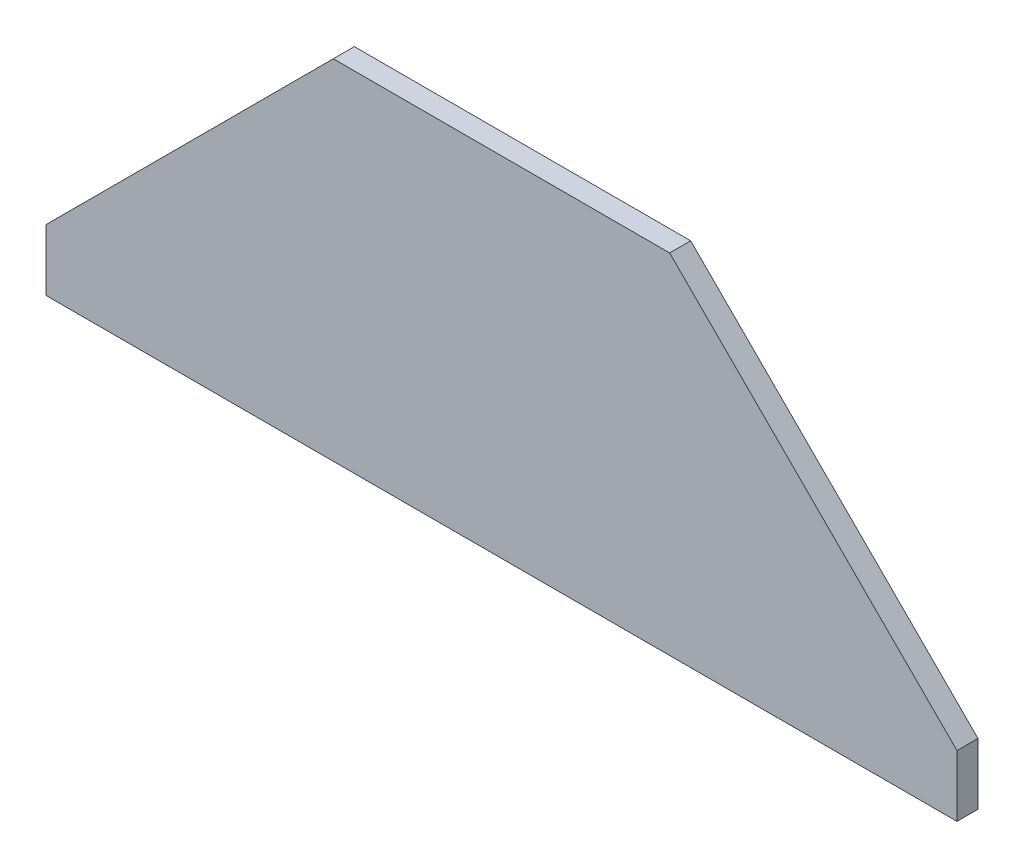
from build123d import *

# Parameters (mm, degrees)
EXTRUDE1_DEPTH = 9.525


with BuildPart() as part:
    # Sketch1 → Extrude1 (new, symmetric)
    with BuildSketch(Plane.XY):
        Polygon((-152.4, 157.95625), (-412.75, -102.39375), (-412.75, -157.95625), (412.75, -157.95625), (412.75, -102.39375), (152.4, 157.95625), align=None)
    extrude(amount=EXTRUDE1_DEPTH, both=True)


solid = part.part
